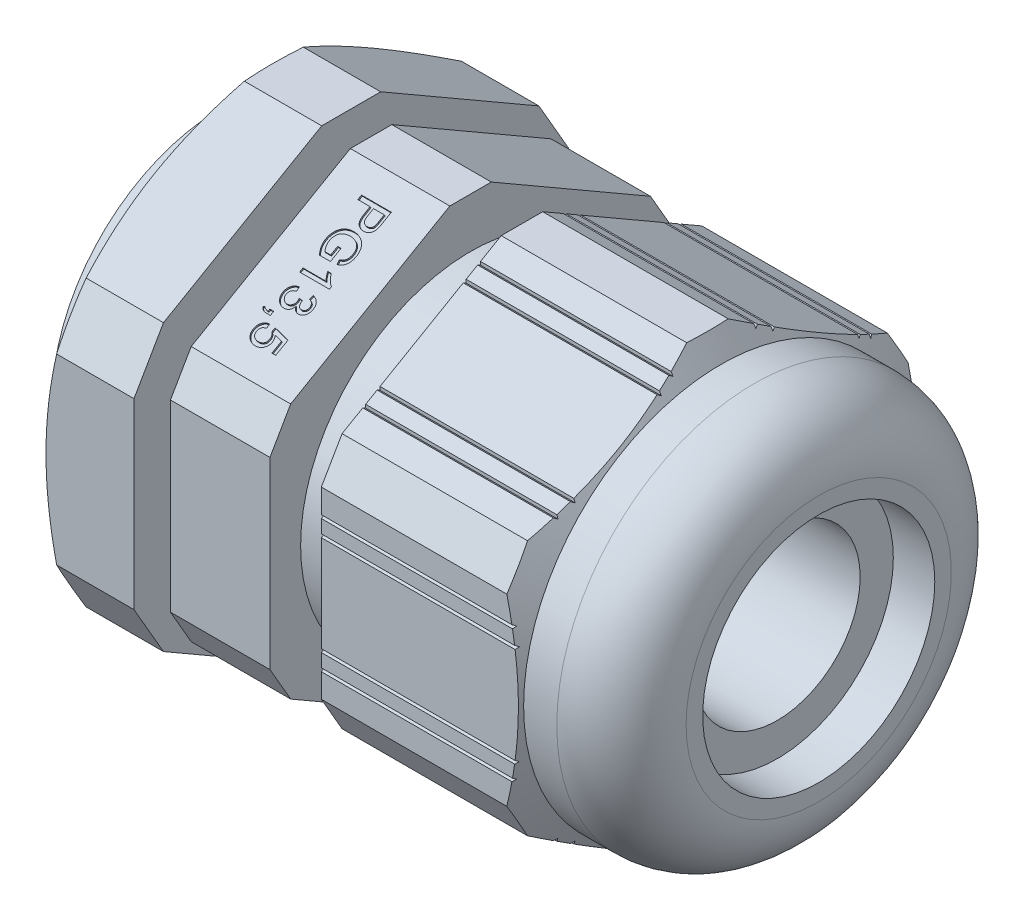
from build123d import *

# Parameters (mm, degrees)
ESBO_O1_R                = 7
RESSALTO_EXTRUS_O1_DEPTH = 18
ESBO_O2_W                = 3.1
ESBO_O2_H                = 3.721876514
ESBO_O2_W_2              = 9
ESBO_O3_OUTSIDE_W        = 36.52
ESBO_O3_OUTSIDE_H        = 40.264
CORTE_EXTRUS_O1_DEPTH    = 36
CORTE_EXTRUS_O3_REACH    = 27.487
PADR_OCIRCULAR2_COUNT    = 6
PORCA_START              = 6
ESBO_O6_R                = 10.25
PORCA_DEPTH              = 6
ESBO_O8_R                = 7
ESBO_O8_R_2              = 5
BORRACHA_DEPTH           = 10
PG13_5_DEPTH             = 0.1


with BuildPart() as part:
    # Esbo_o1 → Ressalto-extrus_o1 (new, symmetric)
    with BuildSketch(Plane(origin=(0, 0, 0), x_dir=(0, 0, -1), z_dir=(1, 0, 0))):
        Polygon((-12.1, 6.985938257), (-12.1, -6.985938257), (0, -13.971876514), (12.1, -6.985938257), (12.1, 6.985938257), (0, 13.971876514), align=None)
        Circle(ESBO_O1_R, mode=Mode.SUBTRACT)
    extrude(amount=RESSALTO_EXTRUS_O1_DEPTH, both=True)

    # Esbo_o2 → Corte-Revolu_o1 (revolve, cut)
    with BuildSketch(Plane.XY, mode=Mode.PRIVATE) as corte_revolu_o1_sk:
        with BuildLine():
            Line((14.1, 11.9), (12.1, 11.9))
            Line((12.1, 11.9), (10.903801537, 13.971876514))
            Line((10.903801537, 13.971876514), (18, 13.971876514))
            Line((18, 13.971876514), (18, 8))
            ThreePointArc((18, 8), (16.857716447, 10.757716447), (14.1, 11.9))
        make_face()
        with Locations((-1.45, 12.110938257)):
            Rectangle(ESBO_O2_W, ESBO_O2_H)
        with Locations((-13.5, 12.110938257)):
            Rectangle(ESBO_O2_W_2, ESBO_O2_H)
    revolve(corte_revolu_o1_sk.sketch.rotate(Axis((0, 0, 0), (1, 0, 0)), 90), axis=Axis((0, 0, 0), (1, 0, 0)), mode=Mode.SUBTRACT)

    # Esbo_o3 outside → Corte-extrus_o1 (cut)
    with BuildSketch(Plane.ZY.offset(9)):
        Rectangle(ESBO_O3_OUTSIDE_W, ESBO_O3_OUTSIDE_H)
        Polygon((-7.649891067, 13.25), (-15.299782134, 0), (-7.649891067, -13.25), (7.649891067, -13.25), (15.299782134, 0), (7.649891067, 13.25), align=None, mode=Mode.SUBTRACT)
    extrude(amount=-CORTE_EXTRUS_O1_DEPTH, mode=Mode.SUBTRACT)

    # Corte-extrus_o3: up to this cone (the profile starts inside it)
    corte_extrus_o3_end = Plane(origin=(0.1, 0, 0), z_dir=(-1, 0, 0)).offset(-18.870467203) * Cone(1.732e-06, 137.770920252, 79.542076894, align=(Align.CENTER, Align.CENTER, Align.MIN), mode=Mode.PRIVATE)
    # Esbo_o5 → Corte-extrus_o3 (cut, up to the surface)
    with BuildSketch(Plane.ZY.offset(-0.1), mode=Mode.PRIVATE) as corte_extrus_o3_sk1:
        Polygon((12.1, 4.1), (11.926794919, 4), (12.1, 3.9), align=None)
    corte_extrus_o3_tool1 = extrude(corte_extrus_o3_sk1.sketch, amount=-CORTE_EXTRUS_O3_REACH, mode=Mode.PRIVATE) & corte_extrus_o3_end
    # Esbo_o5 → Corte-extrus_o3 (cut, up to the surface)
    with BuildSketch(Plane.ZY.offset(-0.1), mode=Mode.PRIVATE) as corte_extrus_o3_sk2:
        Polygon((12.1, 3.1), (11.926794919, 3), (12.1, 2.9), align=None)
    corte_extrus_o3_tool2 = extrude(corte_extrus_o3_sk2.sketch, amount=-CORTE_EXTRUS_O3_REACH, mode=Mode.PRIVATE) & corte_extrus_o3_end
    # Esbo_o5 → Corte-extrus_o3 (cut, up to the surface)
    with BuildSketch(Plane.ZY.offset(-0.1), mode=Mode.PRIVATE) as corte_extrus_o3_sk3:
        Polygon((12.1, -2.9), (12.1, -3.1), (11.926794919, -3), align=None)
    corte_extrus_o3_tool3 = extrude(corte_extrus_o3_sk3.sketch, amount=-CORTE_EXTRUS_O3_REACH, mode=Mode.PRIVATE) & corte_extrus_o3_end
    # Esbo_o5 → Corte-extrus_o3 (cut, up to the surface)
    with BuildSketch(Plane.ZY.offset(-0.1), mode=Mode.PRIVATE) as corte_extrus_o3_sk4:
        Polygon((12.1, -3.9), (12.1, -4.1), (11.926794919, -4), align=None)
    corte_extrus_o3_tool4 = extrude(corte_extrus_o3_sk4.sketch, amount=-CORTE_EXTRUS_O3_REACH, mode=Mode.PRIVATE) & corte_extrus_o3_end
    corte_extrus_o3 = corte_extrus_o3_tool1.solids().sort_by_distance((0.1, 4, 12.042265))[0] + corte_extrus_o3_tool2.solids().sort_by_distance((0.1, 3, 12.042265))[0] + corte_extrus_o3_tool3.solids().sort_by_distance((0.1, -3, 12.042265))[0] + corte_extrus_o3_tool4.solids().sort_by_distance((0.1, -4, 12.042265))[0]
    add(corte_extrus_o3, mode=Mode.SUBTRACT)

    # Padr_oCircular2: Corte-extrus_o3 ×6 about axis
    padr_ocircular2_axis = Axis((0, 0, 0), (1, 0, 0))
    for i in range(1, PADR_OCIRCULAR2_COUNT):
        add(corte_extrus_o3.rotate(padr_ocircular2_axis, i * 360 / PADR_OCIRCULAR2_COUNT), mode=Mode.SUBTRACT)

    # Esbo_o6 → PORCA (add)
    with BuildSketch(Plane.ZY.offset(10.2).offset(PORCA_START)):
        Polygon((-1.778083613, 14.1), (-11.321916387, 8.589865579), (-13.1, 5.510134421), (-13.1, -5.510134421), (-11.321916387, -8.589865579), (-1.778083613, -14.1), (1.778083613, -14.1), (11.321916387, -8.589865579), (13.1, -5.510134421), (13.1, 5.510134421), (11.321916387, 8.589865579), (1.778083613, 14.1), align=None)
        Circle(ESBO_O6_R, mode=Mode.SUBTRACT)
    extrude(amount=-PORCA_DEPTH)

    # Esbo_o7 → Corte-Revolu_o2 (revolve, cut)
    with BuildSketch(Plane.XY):
        Polygon((-16.2, 11.9), (-13.313248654, 16.9), (-16.2, 16.9), align=None)
    revolve(axis=Axis((0, 0, 0), (-1, 0, 0)), mode=Mode.SUBTRACT)

    # Esbo_o9 → PG13_5 (cut)
    # profile 1 of 6: a face of its own
    with BuildSketch(Plane(origin=(0, 10.478907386, 6.05), x_dir=(1, 0, 0), z_dir=(0, 0.8660254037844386, 0.5000000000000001))):
        with BuildLine():
            Line((-7, 4.010528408), (-5.202176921, 4.010528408))
            Line((-5.202176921, 4.010528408), (-5.202176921, 3.350030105))
            add(Edge.make_bspline(
                [(-5.202176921, 3.350030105), (-5.202328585, 3.322652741), (-5.202612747, 3.271357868), (-5.206088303, 3.199561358), (-5.210274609, 3.137901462), (-5.216340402, 3.100543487), (-5.21910354, 3.083525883)],
                knots=[0, 0, 0, 0, 1.22865439, 2.302035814, 3.226529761, 4, 4, 4, 4], degree=3))
            add(Edge.make_bspline(
                [(-5.21910354, 3.083525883), (-5.223100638, 3.062769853), (-5.230848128, 3.022538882), (-5.249484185, 2.965553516), (-5.272864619, 2.913633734), (-5.301442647, 2.866628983), (-5.335828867, 2.824545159), (-5.376380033, 2.787087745), (-5.42310648, 2.754077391), (-5.47515351, 2.725254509), (-5.531799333, 2.70244898), (-5.591701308, 2.685845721), (-5.654386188, 2.675367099), (-5.697208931, 2.674252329), (-5.718979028, 2.673685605)],
                knots=[0, 0, 0, 0, 1.070812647, 2.075533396, 3.03158624, 3.952267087, 4.856280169, 5.777926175, 6.742292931, 7.750234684, 8.787786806, 9.830343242, 10.896996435, 12, 12, 12, 12], degree=3))
            add(Edge.make_bspline(
                [(-5.718979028, 2.673685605), (-5.737606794, 2.674082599), (-5.774257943, 2.674863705), (-5.828103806, 2.681570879), (-5.879905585, 2.692149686), (-5.929309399, 2.707928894), (-5.976890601, 2.727221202), (-6.02185493, 2.751527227), (-6.064782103, 2.7799346), (-6.105740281, 2.812485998), (-6.143362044, 2.851187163), (-6.175503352, 2.897242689), (-6.202642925, 2.95007572), (-6.224394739, 3.010053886), (-6.24144025, 3.076905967), (-6.254035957, 3.150587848), (-6.261002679, 3.231288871), (-6.261942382, 3.287352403), (-6.262431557, 3.316537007)],
                knots=[0, 0, 0, 0, 0.928838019, 1.827539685, 2.70246688, 3.562284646, 4.410746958, 5.259990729, 6.106993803, 6.975772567, 7.865109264, 8.788837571, 9.766371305, 10.819752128, 11.964215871, 13.203620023, 14.544307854, 16, 16, 16, 16], degree=3))
            Line((-6.262431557, 3.316537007), (-6.262431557, 3.756989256))
            Line((-6.262431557, 3.756989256), (-7, 3.756989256))
            Line((-7, 3.756989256), (-7, 4.010528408))
        make_face()
        with BuildLine():
            Line((-6.054990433, 3.756989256), (-6.054990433, 3.323379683))
            add(Edge.make_bspline(
                [(-6.054990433, 3.323379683), (-6.054701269, 3.306085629), (-6.054144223, 3.272770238), (-6.050256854, 3.224631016), (-6.043527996, 3.180451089), (-6.03414321, 3.140107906), (-6.02247819, 3.103550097), (-6.00772515, 3.07084307), (-5.990028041, 3.042155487), (-5.969567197, 3.017297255), (-5.94664606, 2.995959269), (-5.921640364, 2.977470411), (-5.894371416, 2.961761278), (-5.864725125, 2.949447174), (-5.833278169, 2.93901543), (-5.799378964, 2.932504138), (-5.7635191, 2.927976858), (-5.738802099, 2.927478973), (-5.726181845, 2.927224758)],
                knots=[0, 0, 0, 0, 1.403696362, 2.704090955, 3.91683431, 5.027708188, 6.063065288, 7.026749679, 7.932587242, 8.790956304, 9.632005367, 10.468072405, 11.310475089, 12.179234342, 13.069796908, 13.994719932, 14.976123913, 16, 16, 16, 16], degree=3))
            add(Edge.make_bspline(
                [(-5.726181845, 2.927224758), (-5.707880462, 2.927761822), (-5.672418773, 2.928802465), (-5.621390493, 2.939287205), (-5.574239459, 2.955725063), (-5.531858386, 2.979259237), (-5.494678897, 3.007742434), (-5.464259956, 3.041223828), (-5.439941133, 3.078629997), (-5.430312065, 3.106559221), (-5.425464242, 3.120620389)],
                knots=[0, 0, 0, 0, 1.143156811, 2.215038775, 3.243253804, 4.254666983, 5.233799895, 6.158487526, 7.072877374, 8, 8, 8, 8], degree=3))
            add(Edge.make_bspline(
                [(-5.425464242, 3.120620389), (-5.424205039, 3.12577004), (-5.421468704, 3.136960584), (-5.418362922, 3.155497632), (-5.415422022, 3.176981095), (-5.413470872, 3.201515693), (-5.411533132, 3.228877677), (-5.410639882, 3.259150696), (-5.409868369, 3.292403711), (-5.409704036, 3.315576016), (-5.409618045, 3.327701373)],
                knots=[0, 0, 0, 0, 0.611063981, 1.327884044, 2.165719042, 3.110592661, 4.16481496, 5.328235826, 6.601947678, 8, 8, 8, 8], degree=3))
            Line((-5.409618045, 3.327701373), (-5.409618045, 3.756989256))
            Line((-5.409618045, 3.756989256), (-6.054990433, 3.756989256))
        make_face(mode=Mode.SUBTRACT)
    # profile 2 of 6: a face of its own
    with BuildSketch(Plane(origin=(0, 10.478907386, 6.05), x_dir=(1, 0, 0), z_dir=(0, 0.8660254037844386, 0.5000000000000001))):
        with BuildLine():
            Line((-6.285480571, 1.521234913), (-6.078039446, 1.521234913))
            Line((-6.078039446, 1.521234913), (-6.078039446, 0.783666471))
            Line((-6.078039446, 0.783666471), (-6.74321958, 0.783666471))
            add(Edge.make_bspline(
                [(-6.74321958, 0.783666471), (-6.765382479, 0.812767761), (-6.809001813, 0.87004271), (-6.865906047, 0.959858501), (-6.914046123, 1.051081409), (-6.954050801, 1.14340193), (-6.984766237, 1.237483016), (-7.006676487, 1.332810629), (-7.020666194, 1.429344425), (-7.02225404, 1.494177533), (-7.023049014, 1.526637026)],
                knots=[0, 0, 0, 0, 1.084304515, 2.13404583, 3.148352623, 4.140192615, 5.113911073, 6.078424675, 7.037939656, 8, 8, 8, 8], degree=3))
            add(Edge.make_bspline(
                [(-7.023049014, 1.526637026), (-7.022715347, 1.548377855), (-7.022052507, 1.591566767), (-7.016379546, 1.655509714), (-7.007955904, 1.717961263), (-6.995549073, 1.778795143), (-6.979854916, 1.838144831), (-6.960207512, 1.895905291), (-6.937539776, 1.952255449), (-6.911465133, 2.006908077), (-6.881451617, 2.058960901), (-6.848916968, 2.108489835), (-6.812639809, 2.154385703), (-6.773436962, 2.196947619), (-6.730896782, 2.236022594), (-6.685615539, 2.272210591), (-6.636754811, 2.304533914), (-6.585217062, 2.333713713), (-6.53138606, 2.3594623), (-6.475742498, 2.382008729), (-6.418310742, 2.400415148), (-6.359696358, 2.416665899), (-6.299312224, 2.428242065), (-6.237556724, 2.437058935), (-6.17416019, 2.442073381), (-6.131348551, 2.44281899), (-6.10973184, 2.443195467)],
                knots=[0, 0, 0, 0, 1.072785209, 2.131125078, 3.165919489, 4.18145346, 5.19319543, 6.193685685, 7.190467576, 8.189500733, 9.179374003, 10.153807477, 11.111508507, 12.063253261, 13.006625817, 13.959678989, 14.920965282, 15.894678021, 16.880464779, 17.86404133, 18.855172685, 19.855469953, 20.864032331, 21.887090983, 22.933137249, 24, 24, 24, 24], degree=3))
            add(Edge.make_bspline(
                [(-6.10973184, 2.443195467), (-6.088234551, 2.442821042), (-6.045541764, 2.442077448), (-5.981919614, 2.436975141), (-5.919425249, 2.428286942), (-5.85792872, 2.416504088), (-5.797753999, 2.40084767), (-5.738507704, 2.382235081), (-5.680524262, 2.359731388), (-5.623787, 2.334360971), (-5.56935317, 2.305908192), (-5.518216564, 2.273970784), (-5.470650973, 2.239202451), (-5.426927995, 2.201019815), (-5.386293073, 2.160461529), (-5.349951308, 2.11623445), (-5.31704043, 2.06929846), (-5.287867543, 2.019507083), (-5.26241059, 1.967138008), (-5.239989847, 1.912820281), (-5.22138498, 1.856429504), (-5.205688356, 1.798289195), (-5.19402553, 1.73807711), (-5.185252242, 1.67594847), (-5.180241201, 1.611833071), (-5.179502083, 1.568421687), (-5.179127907, 1.546444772)],
                knots=[0, 0, 0, 0, 1.060071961, 2.105262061, 3.145073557, 4.17023897, 5.191105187, 6.20959997, 7.230929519, 8.256368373, 9.273210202, 10.257139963, 11.226862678, 12.175263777, 13.117120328, 14.054725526, 14.994123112, 15.941396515, 16.897159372, 17.863479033, 18.836934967, 19.823443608, 20.831180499, 21.85926455, 22.916257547, 24, 24, 24, 24], degree=3))
            add(Edge.make_bspline(
                [(-5.179127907, 1.546444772), (-5.179906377, 1.514841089), (-5.181433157, 1.452858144), (-5.192882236, 1.362196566), (-5.212959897, 1.276300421), (-5.239825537, 1.195481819), (-5.274440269, 1.121480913), (-5.314531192, 1.054581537), (-5.362264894, 0.99700945), (-5.415981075, 0.946979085), (-5.47750749, 0.904728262), (-5.546938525, 0.868501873), (-5.624576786, 0.836945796), (-5.680144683, 0.821295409), (-5.708895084, 0.81319802)],
                knots=[0, 0, 0, 0, 1.150676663, 2.256772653, 3.320320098, 4.358473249, 5.351958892, 6.289850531, 7.190417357, 8.06583901, 8.954691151, 9.89917112, 10.913047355, 12, 12, 12, 12], degree=3))
            Line((-5.708895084, 0.81319802), (-5.7672379, 1.045128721))
            add(Edge.make_bspline(
                [(-5.7672379, 1.045128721), (-5.745895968, 1.051811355), (-5.705021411, 1.064610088), (-5.648041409, 1.087320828), (-5.598509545, 1.113103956), (-5.555234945, 1.141339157), (-5.517716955, 1.174807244), (-5.485014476, 1.214018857), (-5.45590302, 1.259214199), (-5.431467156, 1.310233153), (-5.411271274, 1.365789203), (-5.3970806, 1.424990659), (-5.388113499, 1.487107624), (-5.387091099, 1.529486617), (-5.386569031, 1.551126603)],
                knots=[0, 0, 0, 0, 1.164623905, 2.230514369, 3.189783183, 4.069010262, 4.914877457, 5.797920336, 6.720606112, 7.707754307, 8.738229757, 9.793726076, 10.873410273, 12, 12, 12, 12], degree=3))
            add(Edge.make_bspline(
                [(-5.386569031, 1.551126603), (-5.387217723, 1.576721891), (-5.388473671, 1.626277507), (-5.397367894, 1.697988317), (-5.412764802, 1.764294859), (-5.434440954, 1.825083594), (-5.461335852, 1.880164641), (-5.491365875, 1.930417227), (-5.526136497, 1.974554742), (-5.564700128, 2.012933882), (-5.605976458, 2.046299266), (-5.648995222, 2.076055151), (-5.694110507, 2.101930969), (-5.725803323, 2.115751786), (-5.741667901, 2.122670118)],
                knots=[0, 0, 0, 0, 1.282165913, 2.482430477, 3.613002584, 4.685891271, 5.708038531, 6.679660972, 7.613314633, 8.514881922, 9.39970426, 10.268853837, 11.133434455, 12, 12, 12, 12], degree=3))
            add(Edge.make_bspline(
                [(-5.741667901, 2.122670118), (-5.769581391, 2.132953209), (-5.825792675, 2.153660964), (-5.914160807, 2.174709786), (-6.006136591, 2.187067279), (-6.068637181, 2.188784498), (-6.100368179, 2.189656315)],
                knots=[0, 0, 0, 0, 0.971838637, 1.957057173, 2.962815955, 4, 4, 4, 4], degree=3))
            add(Edge.make_bspline(
                [(-6.100368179, 2.189656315), (-6.119825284, 2.189532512), (-6.157942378, 2.18928998), (-6.213907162, 2.184926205), (-6.267600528, 2.179243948), (-6.318726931, 2.169933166), (-6.367586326, 2.159142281), (-6.413727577, 2.144741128), (-6.457874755, 2.128881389), (-6.499238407, 2.10959235), (-6.538242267, 2.088350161), (-6.574820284, 2.065054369), (-6.608363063, 2.038907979), (-6.639575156, 2.010647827), (-6.668352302, 1.980153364), (-6.694402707, 1.947270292), (-6.7175409, 1.911952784), (-6.745137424, 1.862444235), (-6.772896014, 1.7972446), (-6.797881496, 1.716477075), (-6.812565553, 1.632930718), (-6.814588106, 1.576392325), (-6.815607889, 1.547885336)],
                knots=[0, 0, 0, 0, 1.07090929, 2.097945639, 3.089137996, 4.042109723, 4.957603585, 5.842006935, 6.701460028, 7.538380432, 8.351768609, 9.145614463, 9.922973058, 10.69034897, 11.461841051, 12.228789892, 12.996877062, 13.783925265, 15.346951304, 16.887853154, 18.430837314, 20, 20, 20, 20], degree=3))
            add(Edge.make_bspline(
                [(-6.815607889, 1.547885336), (-6.814787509, 1.522876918), (-6.813150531, 1.472975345), (-6.801697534, 1.398578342), (-6.782451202, 1.325310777), (-6.756355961, 1.254583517), (-6.726253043, 1.188653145), (-6.694291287, 1.130186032), (-6.662285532, 1.079357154), (-6.637788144, 1.050762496), (-6.626173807, 1.037205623)],
                knots=[0, 0, 0, 0, 1.080743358, 2.156505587, 3.245104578, 4.349795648, 5.410880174, 6.374485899, 7.229335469, 8, 8, 8, 8], degree=3))
            Line((-6.626173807, 1.037205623), (-6.285480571, 1.037205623))
            Line((-6.285480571, 1.037205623), (-6.285480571, 1.521234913))
        make_face()
    # profile 3 of 6: a face of its own
    with BuildSketch(Plane(origin=(0, 10.478907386, 6.05), x_dir=(1, 0, 0), z_dir=(0, 0.8660254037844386, 0.5000000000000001))):
        with BuildLine():
            Line((-7, -0.29963718), (-7, -0.069147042))
            Line((-7, -0.069147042), (-5.599052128, -0.069147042))
            add(Edge.make_bspline(
                [(-5.599052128, -0.069147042), (-5.611849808, -0.055874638), (-5.638448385, -0.028289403), (-5.676115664, 0.018324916), (-5.714127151, 0.070341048), (-5.751175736, 0.126896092), (-5.7853698, 0.184989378), (-5.816571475, 0.240958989), (-5.842839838, 0.294023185), (-5.857216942, 0.328967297), (-5.864115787, 0.345735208)],
                knots=[0, 0, 0, 0, 0.89334793, 1.85672577, 2.901900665, 4.015525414, 5.132247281, 6.168817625, 7.121308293, 8, 8, 8, 8], degree=3))
            Line((-5.864115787, 0.345735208), (-5.65163269, 0.345735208))
            add(Edge.make_bspline(
                [(-5.65163269, 0.345735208), (-5.636799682, 0.316933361), (-5.6075647, 0.260166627), (-5.557071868, 0.179967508), (-5.50233556, 0.105093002), (-5.443367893, 0.036782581), (-5.383092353, -0.02445336), (-5.322271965, -0.076057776), (-5.263136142, -0.119237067), (-5.221895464, -0.140900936), (-5.202176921, -0.151259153)],
                knots=[0, 0, 0, 0, 1.141258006, 2.249351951, 3.335817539, 4.406819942, 5.426913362, 6.360259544, 7.215985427, 8, 8, 8, 8], degree=3))
            Line((-5.202176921, -0.151259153), (-5.202176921, -0.29963718))
            Line((-5.202176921, -0.29963718), (-7, -0.29963718))
        make_face()
    # profile 4 of 6: a face of its own
    with BuildSketch(Plane(origin=(0, 10.478907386, 6.05), x_dir=(1, 0, 0), z_dir=(0, 0.8660254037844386, 0.5000000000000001))):
        with BuildLine():
            Line((-6.515970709, -0.875862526), (-6.492921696, -1.106352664))
            add(Edge.make_bspline(
                [(-6.492921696, -1.106352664), (-6.506769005, -1.10942951), (-6.533562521, -1.115382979), (-6.571978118, -1.126766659), (-6.60747635, -1.13902926), (-6.63987081, -1.153343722), (-6.669406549, -1.168582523), (-6.695898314, -1.185635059), (-6.719460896, -1.204026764), (-6.740175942, -1.223886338), (-6.758003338, -1.245505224), (-6.773624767, -1.268570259), (-6.786543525, -1.293511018), (-6.797116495, -1.320188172), (-6.805237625, -1.348564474), (-6.811463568, -1.37863523), (-6.815097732, -1.41046153), (-6.815435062, -1.432270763), (-6.815607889, -1.443444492)],
                knots=[0, 0, 0, 0, 1.320986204, 2.55601031, 3.730253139, 4.816881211, 5.852298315, 6.823203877, 7.747118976, 8.63288941, 9.490542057, 10.352775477, 11.223092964, 12.1014913, 13.021608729, 13.969046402, 14.959462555, 16, 16, 16, 16], degree=3))
            add(Edge.make_bspline(
                [(-6.815607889, -1.443444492), (-6.815421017, -1.456551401), (-6.815056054, -1.482149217), (-6.809580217, -1.519449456), (-6.802061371, -1.554947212), (-6.790271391, -1.588136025), (-6.775861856, -1.619478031), (-6.758054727, -1.648794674), (-6.737144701, -1.676286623), (-6.712989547, -1.70141162), (-6.686418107, -1.723880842), (-6.658351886, -1.743892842), (-6.628551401, -1.760440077), (-6.597436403, -1.774386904), (-6.564504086, -1.784681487), (-6.530165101, -1.792217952), (-6.494264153, -1.797143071), (-6.469769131, -1.797593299), (-6.457267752, -1.797823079)],
                knots=[0, 0, 0, 0, 1.111377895, 2.170522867, 3.193923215, 4.186422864, 5.152846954, 6.117443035, 7.091571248, 8.078879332, 9.069127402, 10.041602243, 10.999610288, 11.957618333, 12.930786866, 13.922135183, 14.939532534, 16, 16, 16, 16], degree=3))
            add(Edge.make_bspline(
                [(-6.457267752, -1.797823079), (-6.445362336, -1.797607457), (-6.4220545, -1.797185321), (-6.388020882, -1.792074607), (-6.355438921, -1.785255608), (-6.324644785, -1.774523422), (-6.295192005, -1.761272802), (-6.267608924, -1.744561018), (-6.241256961, -1.725365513), (-6.21711234, -1.703049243), (-6.19469424, -1.678858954), (-6.175656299, -1.652331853), (-6.159217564, -1.624429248), (-6.145946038, -1.594801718), (-6.135411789, -1.563576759), (-6.12784076, -1.530782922), (-6.123495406, -1.496262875), (-6.122966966, -1.472748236), (-6.122696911, -1.460731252)],
                knots=[0, 0, 0, 0, 1.072945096, 2.100558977, 3.098942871, 4.071504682, 5.035832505, 6.007127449, 6.975278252, 7.971781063, 8.968283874, 9.945176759, 10.910962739, 11.885150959, 12.867967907, 13.879305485, 14.91623465, 16, 16, 16, 16], degree=3))
            add(Edge.make_bspline(
                [(-6.122696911, -1.460731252), (-6.12298414, -1.450151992), (-6.12359694, -1.427581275), (-6.128745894, -1.39212491), (-6.136238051, -1.352893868), (-6.143406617, -1.325877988), (-6.147186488, -1.311632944)],
                knots=[0, 0, 0, 0, 0.83759105, 1.78699, 2.83311496, 4, 4, 4, 4], degree=3))
            Line((-6.147186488, -1.311632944), (-5.939745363, -1.335402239))
            add(Edge.make_bspline(
                [(-5.939745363, -1.335402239), (-5.940426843, -1.341638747), (-5.941630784, -1.352656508), (-5.942074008, -1.363729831), (-5.942266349, -1.368535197)],
                knots=[0, 0, 0, 0, 1.132082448, 2, 2, 2, 2], degree=3))
            add(Edge.make_bspline(
                [(-5.942266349, -1.368535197), (-5.941431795, -1.389606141), (-5.93978544, -1.431173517), (-5.926845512, -1.491759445), (-5.905642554, -1.549117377), (-5.881458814, -1.59377575), (-5.857548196, -1.626317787), (-5.837084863, -1.647520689), (-5.814231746, -1.665625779), (-5.789150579, -1.680336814), (-5.761555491, -1.69152902), (-5.732010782, -1.699940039), (-5.700028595, -1.704459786), (-5.678055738, -1.705230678), (-5.666758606, -1.705627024)],
                knots=[0, 0, 0, 0, 1.549252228, 3.056263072, 4.534504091, 6.036615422, 6.774983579, 7.499541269, 8.197503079, 8.913995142, 9.630759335, 10.382943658, 11.168606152, 12, 12, 12, 12], degree=3))
            add(Edge.make_bspline(
                [(-5.666758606, -1.705627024), (-5.657622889, -1.705456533), (-5.639756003, -1.7051231), (-5.613559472, -1.701414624), (-5.588744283, -1.695268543), (-5.565013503, -1.687004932), (-5.542665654, -1.67604355), (-5.521223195, -1.663047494), (-5.500967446, -1.647555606), (-5.482439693, -1.629410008), (-5.465094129, -1.609917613), (-5.450336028, -1.588399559), (-5.437553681, -1.565709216), (-5.427616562, -1.5414361), (-5.419563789, -1.516033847), (-5.41390004, -1.4892582), (-5.410102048, -1.461080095), (-5.40978165, -1.441776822), (-5.409618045, -1.431919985)],
                knots=[0, 0, 0, 0, 1.04118494, 2.036264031, 3.009060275, 3.95291637, 4.895779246, 5.841915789, 6.808431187, 7.795948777, 8.795256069, 9.778780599, 10.765348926, 11.759391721, 12.763842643, 13.800247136, 14.876739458, 16, 16, 16, 16], degree=3))
            add(Edge.make_bspline(
                [(-5.409618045, -1.431919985), (-5.410370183, -1.412630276), (-5.411822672, -1.375378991), (-5.425261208, -1.322045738), (-5.447006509, -1.273716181), (-5.472507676, -1.237935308), (-5.496888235, -1.212527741), (-5.51755357, -1.195173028), (-5.540374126, -1.17965022), (-5.565341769, -1.165915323), (-5.59255691, -1.1541539), (-5.621682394, -1.143551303), (-5.65318452, -1.13534391), (-5.675012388, -1.131415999), (-5.686206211, -1.129401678)],
                knots=[0, 0, 0, 0, 1.533565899, 2.961543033, 4.347411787, 5.731829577, 6.434842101, 7.147085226, 7.87612511, 8.629021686, 9.412189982, 10.234506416, 11.094615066, 12, 12, 12, 12], degree=3))
            Line((-5.686206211, -1.129401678), (-5.663157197, -0.89891154))
            add(Edge.make_bspline(
                [(-5.663157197, -0.89891154), (-5.64533544, -0.902517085), (-5.610376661, -0.909589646), (-5.559886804, -0.923998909), (-5.512490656, -0.941570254), (-5.468408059, -0.962669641), (-5.427102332, -0.986291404), (-5.389096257, -1.013566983), (-5.353977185, -1.043795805), (-5.322378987, -1.077428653), (-5.293976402, -1.113274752), (-5.269111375, -1.151368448), (-5.24876945, -1.191860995), (-5.231618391, -1.234335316), (-5.218313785, -1.27894265), (-5.209090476, -1.325737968), (-5.203057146, -1.374499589), (-5.202473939, -1.407772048), (-5.202176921, -1.424717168)],
                knots=[0, 0, 0, 0, 1.136675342, 2.229678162, 3.279607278, 4.293661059, 5.282505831, 6.25114153, 7.214380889, 8.175511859, 9.132176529, 10.071243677, 11.014621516, 11.96113019, 12.932525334, 13.920372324, 14.940879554, 16, 16, 16, 16], degree=3))
            add(Edge.make_bspline(
                [(-5.202176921, -1.424717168), (-5.202934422, -1.44817549), (-5.204423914, -1.494302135), (-5.216368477, -1.562150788), (-5.235745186, -1.627100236), (-5.262732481, -1.688476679), (-5.295962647, -1.745035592), (-5.335409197, -1.795260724), (-5.380866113, -1.838310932), (-5.431673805, -1.8733275), (-5.485774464, -1.901053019), (-5.541931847, -1.921569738), (-5.600083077, -1.933828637), (-5.639451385, -1.935352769), (-5.659195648, -1.936117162)],
                knots=[0, 0, 0, 0, 1.104597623, 2.171996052, 3.234829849, 4.29087057, 5.322891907, 6.317459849, 7.289649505, 8.260785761, 9.214372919, 10.146451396, 11.070395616, 12, 12, 12, 12], degree=3))
            add(Edge.make_bspline(
                [(-5.659195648, -1.936117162), (-5.677859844, -1.935342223), (-5.714711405, -1.933812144), (-5.768594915, -1.922032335), (-5.819643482, -1.902126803), (-5.868036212, -1.875221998), (-5.912726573, -1.840333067), (-5.952549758, -1.797555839), (-5.987886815, -1.747574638), (-6.006279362, -1.710117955), (-6.015735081, -1.69086125)],
                knots=[0, 0, 0, 0, 0.975609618, 1.926294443, 2.868398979, 3.832526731, 4.812148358, 5.820404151, 6.879456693, 8, 8, 8, 8], degree=3))
            add(Edge.make_bspline(
                [(-6.015735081, -1.69086125), (-6.018994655, -1.703771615), (-6.025379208, -1.729059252), (-6.038608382, -1.765377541), (-6.054094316, -1.799522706), (-6.071641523, -1.831940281), (-6.092366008, -1.861721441), (-6.11518072, -1.88983869), (-6.140669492, -1.915595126), (-6.168491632, -1.939131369), (-6.198472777, -1.959962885), (-6.230184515, -1.978458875), (-6.263844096, -1.993961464), (-6.299384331, -2.006656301), (-6.336773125, -2.016286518), (-6.376046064, -2.02303995), (-6.416948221, -2.02753338), (-6.444890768, -2.028050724), (-6.459068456, -2.028313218)],
                knots=[0, 0, 0, 0, 1.053070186, 2.062657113, 3.053206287, 4.018286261, 4.974725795, 5.91977648, 6.880311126, 7.8375051, 8.799354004, 9.765508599, 10.738781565, 11.727279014, 12.747932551, 13.789587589, 14.878465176, 16, 16, 16, 16], degree=3))
            add(Edge.make_bspline(
                [(-6.459068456, -2.028313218), (-6.478423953, -2.027874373), (-6.516463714, -2.027011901), (-6.572346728, -2.018840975), (-6.625883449, -2.005475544), (-6.677287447, -1.98702277), (-6.726593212, -1.963510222), (-6.773614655, -1.934608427), (-6.817991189, -1.900013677), (-6.85999217, -1.861010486), (-6.898185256, -1.817880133), (-6.931614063, -1.771425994), (-6.959862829, -1.722189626), (-6.982924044, -1.670140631), (-7.001035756, -1.615384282), (-7.014020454, -1.55787496), (-7.021651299, -1.497432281), (-7.022576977, -1.456191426), (-7.023049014, -1.435161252)],
                knots=[0, 0, 0, 0, 1.015966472, 1.996700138, 2.958466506, 3.909678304, 4.859970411, 5.822294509, 6.80209563, 7.810207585, 8.828518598, 9.822296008, 10.810699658, 11.804157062, 12.806952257, 13.834723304, 14.89584865, 16, 16, 16, 16], degree=3))
            add(Edge.make_bspline(
                [(-7.023049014, -1.435161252), (-7.022692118, -1.416288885), (-7.021989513, -1.379135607), (-7.014718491, -1.324742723), (-7.004276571, -1.272550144), (-6.988567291, -1.22305144), (-6.968846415, -1.175864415), (-6.94408091, -1.131563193), (-6.9154952, -1.089321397), (-6.882433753, -1.049986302), (-6.845935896, -1.013787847), (-6.806549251, -0.981493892), (-6.764359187, -0.953763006), (-6.719997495, -0.929312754), (-6.672627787, -0.909550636), (-6.622656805, -0.894162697), (-6.570269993, -0.882429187), (-6.534267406, -0.878075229), (-6.515970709, -0.875862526)],
                knots=[0, 0, 0, 0, 1.084695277, 2.135396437, 3.150895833, 4.142217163, 5.116736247, 6.087040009, 7.055967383, 8.045989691, 9.036998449, 10.008504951, 10.9697278, 11.936710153, 12.917591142, 13.915501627, 14.940647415, 16, 16, 16, 16], degree=3))
        make_face()
    # profile 5 of 6: a face of its own
    with BuildSketch(Plane(origin=(0, 10.478907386, 6.05), x_dir=(1, 0, 0), z_dir=(0, 0.8660254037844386, 0.5000000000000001))):
        with BuildLine():
            Line((-7, -2.374048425), (-6.769509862, -2.374048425))
            Line((-6.769509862, -2.374048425), (-6.769509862, -2.604538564))
            Line((-6.769509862, -2.604538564), (-7, -2.604538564))
            add(Edge.make_bspline(
                [(-7, -2.604538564), (-7.022834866, -2.604010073), (-7.06638782, -2.603002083), (-7.128233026, -2.594824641), (-7.183275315, -2.581229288), (-7.232191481, -2.562367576), (-7.274684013, -2.536260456), (-7.311768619, -2.503888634), (-7.343845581, -2.46507401), (-7.360357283, -2.435327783), (-7.368784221, -2.420146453)],
                knots=[0, 0, 0, 0, 1.252661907, 2.389202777, 3.414870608, 4.357956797, 5.253829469, 6.136233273, 7.048805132, 8, 8, 8, 8], degree=3))
            Line((-7.368784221, -2.420146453), (-7.276588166, -2.374048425))
            add(Edge.make_bspline(
                [(-7.276588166, -2.374048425), (-7.270891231, -2.383160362), (-7.25955443, -2.401292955), (-7.237010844, -2.42451942), (-7.210901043, -2.444109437), (-7.180429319, -2.460045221), (-7.144513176, -2.471788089), (-7.102366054, -2.480552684), (-7.053461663, -2.486616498), (-7.018506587, -2.487895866), (-7, -2.488573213)],
                knots=[0, 0, 0, 0, 0.818684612, 1.629167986, 2.454191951, 3.302962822, 4.242204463, 5.329983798, 6.586388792, 8, 8, 8, 8], degree=3))
            Line((-7, -2.488573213), (-7, -2.374048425))
        make_face()
    # profile 6 of 6: a face of its own
    with BuildSketch(Plane(origin=(0, 10.478907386, 6.05), x_dir=(1, 0, 0), z_dir=(0, 0.8660254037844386, 0.5000000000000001))):
        with BuildLine():
            Line((-6.515970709, -2.950273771), (-6.492921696, -3.18076391))
            add(Edge.make_bspline(
                [(-6.492921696, -3.18076391), (-6.50590855, -3.183046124), (-6.531170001, -3.187485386), (-6.567736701, -3.195944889), (-6.601708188, -3.206931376), (-6.633378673, -3.219275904), (-6.662413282, -3.233949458), (-6.689270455, -3.249848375), (-6.712996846, -3.268597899), (-6.734833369, -3.288310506), (-6.754075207, -3.309946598), (-6.770296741, -3.333714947), (-6.784449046, -3.358952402), (-6.796036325, -3.385966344), (-6.804517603, -3.414798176), (-6.811224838, -3.445080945), (-6.814604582, -3.477204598), (-6.815269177, -3.499122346), (-6.815607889, -3.510292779)],
                knots=[0, 0, 0, 0, 1.237781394, 2.407677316, 3.51963579, 4.58689595, 5.594855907, 6.570874, 7.510833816, 8.428091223, 9.330271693, 10.221190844, 11.124215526, 12.043132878, 12.973586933, 13.941700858, 14.950982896, 16, 16, 16, 16], degree=3))
            add(Edge.make_bspline(
                [(-6.815607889, -3.510292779), (-6.81527677, -3.523996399), (-6.814629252, -3.550794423), (-6.809152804, -3.589780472), (-6.800122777, -3.626605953), (-6.787485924, -3.661094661), (-6.771770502, -3.69365091), (-6.751421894, -3.723194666), (-6.728548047, -3.751336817), (-6.701278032, -3.77626641), (-6.671590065, -3.798959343), (-6.639184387, -3.818545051), (-6.604515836, -3.835033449), (-6.567591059, -3.848914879), (-6.528199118, -3.859165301), (-6.48654957, -3.866705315), (-6.442615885, -3.871545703), (-6.412503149, -3.872001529), (-6.397124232, -3.872234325)],
                knots=[0, 0, 0, 0, 1.052816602, 2.058828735, 3.018813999, 3.961574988, 4.877590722, 5.788574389, 6.712363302, 7.658909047, 8.620312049, 9.580784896, 10.562948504, 11.56722449, 12.607883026, 13.686460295, 14.818448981, 16, 16, 16, 16], degree=3))
            add(Edge.make_bspline(
                [(-6.397124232, -3.872234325), (-6.382468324, -3.871969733), (-6.353929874, -3.871454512), (-6.312373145, -3.867115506), (-6.273297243, -3.859795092), (-6.236271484, -3.850323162), (-6.201874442, -3.837267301), (-6.169607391, -3.821782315), (-6.140155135, -3.802812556), (-6.112600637, -3.781707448), (-6.087899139, -3.75760275), (-6.067041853, -3.730172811), (-6.048787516, -3.700493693), (-6.033984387, -3.667967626), (-6.022986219, -3.632575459), (-6.014524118, -3.594668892), (-6.010073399, -3.553854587), (-6.009293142, -3.525788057), (-6.008892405, -3.511373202)],
                knots=[0, 0, 0, 0, 1.165854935, 2.270189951, 3.319242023, 4.32700288, 5.306253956, 6.24172124, 7.169108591, 8.088047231, 8.999810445, 9.905349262, 10.822648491, 11.767237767, 12.739852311, 13.766490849, 14.852878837, 16, 16, 16, 16], degree=3))
            add(Edge.make_bspline(
                [(-6.008892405, -3.511373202), (-6.009430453, -3.493451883), (-6.010465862, -3.458964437), (-6.018766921, -3.409532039), (-6.032631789, -3.364625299), (-6.052902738, -3.324689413), (-6.077243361, -3.288931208), (-6.104770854, -3.256690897), (-6.135483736, -3.227707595), (-6.158606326, -3.211808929), (-6.170235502, -3.203812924)],
                knots=[0, 0, 0, 0, 1.182839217, 2.276233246, 3.299105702, 4.274010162, 5.221622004, 6.149363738, 7.06924902, 8, 8, 8, 8], degree=3))
            Line((-6.170235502, -3.203812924), (-6.147186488, -2.973322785))
            Line((-6.147186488, -2.973322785), (-5.225225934, -3.157714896))
            Line((-5.225225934, -3.157714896), (-5.225225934, -4.010528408))
            Line((-5.225225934, -4.010528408), (-5.455716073, -4.010528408))
            Line((-5.455716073, -4.010528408), (-5.455716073, -3.346068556))
            Line((-5.455716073, -3.346068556), (-5.921378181, -3.254592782))
            add(Edge.make_bspline(
                [(-5.921378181, -3.254592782), (-5.911835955, -3.267311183), (-5.893096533, -3.292288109), (-5.868536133, -3.331237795), (-5.847973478, -3.370683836), (-5.83076156, -3.410418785), (-5.817809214, -3.450993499), (-5.808547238, -3.491965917), (-5.802368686, -3.533395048), (-5.801757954, -3.56117078), (-5.80145128, -3.575118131)],
                knots=[0, 0, 0, 0, 1.093799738, 2.148049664, 3.164132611, 4.152263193, 5.124065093, 6.089950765, 7.040884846, 8, 8, 8, 8], degree=3))
            add(Edge.make_bspline(
                [(-5.80145128, -3.575118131), (-5.801926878, -3.593270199), (-5.802863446, -3.629016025), (-5.810558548, -3.681688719), (-5.823621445, -3.732052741), (-5.841215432, -3.780502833), (-5.864538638, -3.826401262), (-5.892780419, -3.870208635), (-5.926162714, -3.911764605), (-5.964097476, -3.950770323), (-6.006027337, -3.986295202), (-6.051266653, -4.017430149), (-6.099498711, -4.043921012), (-6.150667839, -4.065508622), (-6.204865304, -4.082161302), (-6.261788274, -4.093862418), (-6.321659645, -4.101299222), (-6.362528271, -4.102242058), (-6.38343888, -4.102724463)],
                knots=[0, 0, 0, 0, 0.992032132, 1.95355186, 2.902219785, 3.832411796, 4.765723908, 5.710502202, 6.67700341, 7.674814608, 8.68064359, 9.676380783, 10.672053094, 11.683731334, 12.707113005, 13.766394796, 14.857166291, 16, 16, 16, 16], degree=3))
            add(Edge.make_bspline(
                [(-6.38343888, -4.102724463), (-6.403384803, -4.102320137), (-6.442783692, -4.101521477), (-6.500825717, -4.094860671), (-6.556860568, -4.08417162), (-6.61062915, -4.068878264), (-6.662607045, -4.049899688), (-6.712153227, -4.025854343), (-6.760251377, -3.998363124), (-6.78988788, -3.976269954), (-6.804803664, -3.965150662)],
                knots=[0, 0, 0, 0, 1.059762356, 2.093333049, 3.100576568, 4.08823236, 5.061210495, 6.037154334, 7.012117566, 8, 8, 8, 8], degree=3))
            add(Edge.make_bspline(
                [(-6.804803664, -3.965150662), (-6.822216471, -3.9510282), (-6.856469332, -3.923247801), (-6.900927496, -3.875146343), (-6.938710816, -3.823436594), (-6.969407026, -3.767810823), (-6.994074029, -3.708642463), (-7.010488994, -3.645204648), (-7.021512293, -3.578263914), (-7.022529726, -3.532307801), (-7.023049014, -3.508852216)],
                knots=[0, 0, 0, 0, 1.023140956, 2.012628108, 2.982342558, 3.942221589, 4.908720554, 5.902469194, 6.929439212, 8, 8, 8, 8], degree=3))
            add(Edge.make_bspline(
                [(-7.023049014, -3.508852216), (-7.02265653, -3.489505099), (-7.021888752, -3.451658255), (-7.015215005, -3.396243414), (-7.004570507, -3.343538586), (-6.989310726, -3.293521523), (-6.970001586, -3.246062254), (-6.945619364, -3.201724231), (-6.917382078, -3.159918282), (-6.884938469, -3.121184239), (-6.849139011, -3.08542453), (-6.809639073, -3.054146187), (-6.767529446, -3.026639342), (-6.722934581, -3.002539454), (-6.67497636, -2.983778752), (-6.624617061, -2.968071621), (-6.571359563, -2.956424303), (-6.534627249, -2.952345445), (-6.515970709, -2.950273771)],
                knots=[0, 0, 0, 0, 1.108944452, 2.169317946, 3.195242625, 4.188124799, 5.163410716, 6.127483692, 7.083934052, 8.051587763, 9.020146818, 9.980082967, 10.934624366, 11.901494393, 12.880562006, 13.882043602, 14.924278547, 16, 16, 16, 16], degree=3))
        make_face()
    extrude(amount=-PG13_5_DEPTH, mode=Mode.SUBTRACT)


with BuildPart() as body_2:
    # Esbo_o8 → BORRACHA (new body)
    with BuildSketch(Plane(origin=(15.5, 0, 0), x_dir=(0, 0, -1), z_dir=(1, 0, 0))):
        Circle(ESBO_O8_R)
        Circle(ESBO_O8_R_2, mode=Mode.SUBTRACT)
    extrude(amount=-BORRACHA_DEPTH)


solid = Compound([part.part, body_2.part])
